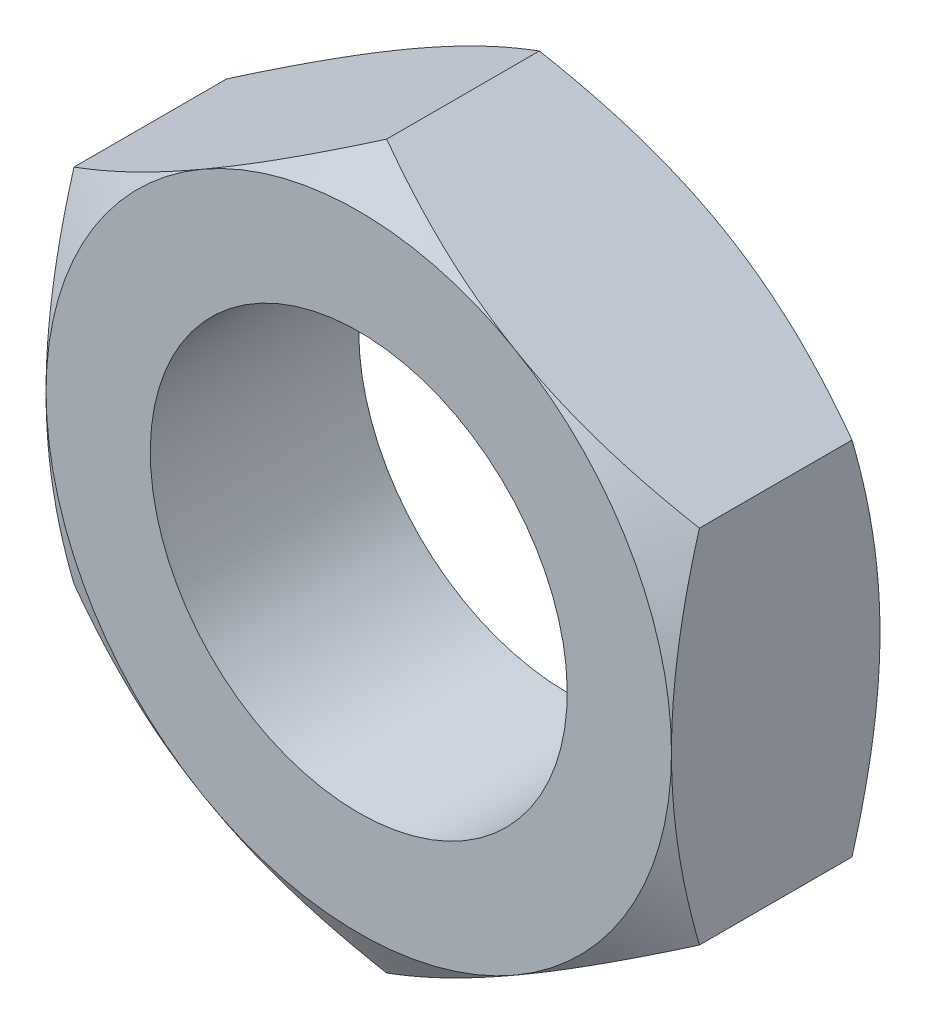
ISO-10303-21;
HEADER;
FILE_DESCRIPTION(('STEP AP214'),'2;1');
FILE_NAME('part.step','',(''),(''),'','','');
FILE_SCHEMA(('AUTOMOTIVE_DESIGN { 1 0 10303 214 1 1 1 1 }'));
ENDSEC;
DATA;
#1=APPLICATION_CONTEXT('core data for automotive mechanical design processes');
#2=APPLICATION_PROTOCOL_DEFINITION('international standard','automotive_design',2000,#1);
#3=PRODUCT_CONTEXT('',#1,'mechanical');
#4=PRODUCT('Part','Part','',(#3));
#5=PRODUCT_RELATED_PRODUCT_CATEGORY('part','',(#4));
#6=PRODUCT_DEFINITION_FORMATION('','',#4);
#7=PRODUCT_DEFINITION_CONTEXT('part definition',#1,'design');
#8=PRODUCT_DEFINITION('design','',#6,#7);
#9=PRODUCT_DEFINITION_SHAPE('','',#8);
#10=(LENGTH_UNIT() NAMED_UNIT(*) SI_UNIT(.MILLI.,.METRE.));
#11=(NAMED_UNIT(*) PLANE_ANGLE_UNIT() SI_UNIT($,.RADIAN.));
#12=(NAMED_UNIT(*) SI_UNIT($,.STERADIAN.) SOLID_ANGLE_UNIT());
#13=UNCERTAINTY_MEASURE_WITH_UNIT(LENGTH_MEASURE(1.E-05),#10,'distance_accuracy_value','');
#14=(GEOMETRIC_REPRESENTATION_CONTEXT(3) GLOBAL_UNCERTAINTY_ASSIGNED_CONTEXT((#13)) GLOBAL_UNIT_ASSIGNED_CONTEXT((#10,
#11,#12)) REPRESENTATION_CONTEXT('',''));
#15=CARTESIAN_POINT('',(0.,0.,0.));
#16=DIRECTION('',(0.,0.,1.));
#17=DIRECTION('',(1.,0.,0.));
#18=AXIS2_PLACEMENT_3D('',#15,#16,#17);
#19=CARTESIAN_POINT('',(8.,0.,0.));
#20=DIRECTION('',(0.,0.,-1.));
#21=DIRECTION('',(0.,1.,0.));
#22=AXIS2_PLACEMENT_3D('',#19,#20,#21);
#23=PLANE('',#22);
#24=CARTESIAN_POINT('',(0.,0.,0.));
#25=DIRECTION('',(0.,0.,-1.));
#26=DIRECTION('',(0.,1.,0.));
#27=AXIS2_PLACEMENT_3D('',#24,#25,#26);
#28=CIRCLE('',#27,8.);
#29=CARTESIAN_POINT('',(0.,8.,0.));
#30=VERTEX_POINT('',#29);
#31=EDGE_CURVE('E109',#30,#30,#28,.T.);
#32=ORIENTED_EDGE('',*,*,#31,.F.);
#33=EDGE_LOOP('',(#32));
#34=FACE_BOUND('',#33,.T.);
#35=CARTESIAN_POINT('',(0.,0.,0.));
#36=DIRECTION('',(0.,0.,1.));
#37=DIRECTION('',(0.,-1.,0.));
#38=AXIS2_PLACEMENT_3D('',#35,#36,#37);
#39=CIRCLE('',#38,12.);
#40=CARTESIAN_POINT('',(-6.,10.3923048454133,0.));
#41=VERTEX_POINT('',#40);
#42=CARTESIAN_POINT('',(-12.,0.,0.));
#43=VERTEX_POINT('',#42);
#44=EDGE_CURVE('E415',#41,#43,#39,.T.);
#45=ORIENTED_EDGE('',*,*,#44,.F.);
#46=CARTESIAN_POINT('',(0.,0.,0.));
#47=DIRECTION('',(0.,0.,1.));
#48=DIRECTION('',(0.,-1.,0.));
#49=AXIS2_PLACEMENT_3D('',#46,#47,#48);
#50=CIRCLE('',#49,12.);
#51=CARTESIAN_POINT('',(6.,10.3923048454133,0.));
#52=VERTEX_POINT('',#51);
#53=EDGE_CURVE('E104',#52,#41,#50,.T.);
#54=ORIENTED_EDGE('',*,*,#53,.F.);
#55=CARTESIAN_POINT('',(0.,0.,0.));
#56=DIRECTION('',(0.,0.,1.));
#57=DIRECTION('',(0.,-1.,0.));
#58=AXIS2_PLACEMENT_3D('',#55,#56,#57);
#59=CIRCLE('',#58,12.);
#60=CARTESIAN_POINT('',(12.,0.,0.));
#61=VERTEX_POINT('',#60);
#62=EDGE_CURVE('E17',#61,#52,#59,.T.);
#63=ORIENTED_EDGE('',*,*,#62,.F.);
#64=CARTESIAN_POINT('',(0.,0.,0.));
#65=DIRECTION('',(0.,0.,1.));
#66=DIRECTION('',(0.,-1.,0.));
#67=AXIS2_PLACEMENT_3D('',#64,#65,#66);
#68=CIRCLE('',#67,12.);
#69=CARTESIAN_POINT('',(6.,-10.3923048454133,0.));
#70=VERTEX_POINT('',#69);
#71=EDGE_CURVE('E101',#70,#61,#68,.T.);
#72=ORIENTED_EDGE('',*,*,#71,.F.);
#73=CARTESIAN_POINT('',(0.,0.,0.));
#74=DIRECTION('',(0.,0.,1.));
#75=DIRECTION('',(0.,-1.,0.));
#76=AXIS2_PLACEMENT_3D('',#73,#74,#75);
#77=CIRCLE('',#76,12.);
#78=CARTESIAN_POINT('',(-6.,-10.3923048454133,0.));
#79=VERTEX_POINT('',#78);
#80=EDGE_CURVE('E119',#79,#70,#77,.T.);
#81=ORIENTED_EDGE('',*,*,#80,.F.);
#82=CARTESIAN_POINT('',(0.,0.,0.));
#83=DIRECTION('',(0.,0.,1.));
#84=DIRECTION('',(0.,-1.,0.));
#85=AXIS2_PLACEMENT_3D('',#82,#83,#84);
#86=CIRCLE('',#85,12.);
#87=EDGE_CURVE('E417',#43,#79,#86,.T.);
#88=ORIENTED_EDGE('',*,*,#87,.F.);
#89=EDGE_LOOP('',(#45,#54,#63,#72,#81,#88));
#90=FACE_BOUND('',#89,.T.);
#91=ADVANCED_FACE('F14',(#34,#90),#23,.T.);
#92=CARTESIAN_POINT('',(0.,0.,1.07822755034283));
#93=DIRECTION('',(0.,0.,1.));
#94=DIRECTION('',(0.,-1.,0.));
#95=AXIS2_PLACEMENT_3D('',#92,#93,#94);
#96=CONICAL_SURFACE('',#95,13.8675448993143,1.0471975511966);
#97=CARTESIAN_POINT('',(12.,6.92820323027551,1.07179676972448));
#98=CARTESIAN_POINT('',(11.5113783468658,7.21030907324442,0.908940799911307));
#99=CARTESIAN_POINT('',(11.0191704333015,7.49448544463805,0.759755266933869));
#100=CARTESIAN_POINT('',(10.2769700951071,7.92299500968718,0.562274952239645));
#101=CARTESIAN_POINT('',(10.0295356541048,8.06585135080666,0.500950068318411));
#102=CARTESIAN_POINT('',(9.53304466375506,8.35250055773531,0.387776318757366));
#103=CARTESIAN_POINT('',(9.28398821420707,8.49629336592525,0.33592687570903));
#104=CARTESIAN_POINT('',(8.78411651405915,8.78489442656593,0.242530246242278));
#105=CARTESIAN_POINT('',(8.53329950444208,8.92970369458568,0.200995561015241));
#106=CARTESIAN_POINT('',(8.03046584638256,9.22001484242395,0.129101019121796));
#107=CARTESIAN_POINT('',(7.77844922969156,9.36551670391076,0.0987408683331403));
#108=CARTESIAN_POINT('',(7.2722827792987,9.65775204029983,0.0497242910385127));
#109=CARTESIAN_POINT('',(7.01812858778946,9.80448803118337,0.0311273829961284));
#110=CARTESIAN_POINT('',(6.50932036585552,10.0982485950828,0.00623934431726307));
#111=CARTESIAN_POINT('',(6.25466624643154,10.2452732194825,-4.93491989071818E-05));
#112=CARTESIAN_POINT('',(6.,10.3923048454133,0.));
#113=B_SPLINE_CURVE_WITH_KNOTS('',3,(#97,#98,#99,#100,#101,#102,#103,#104,#105,#106,#107,#108,
#109,#110,#111,#112),.UNSPECIFIED.,.F.,.F.,(4,2,2,2,2,2,2,4),(0.,1.76168798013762,
2.63822760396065,3.51471379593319,4.39225713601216,5.26977737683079,6.15170281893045,
7.03380287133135),.UNSPECIFIED.);
#114=CARTESIAN_POINT('',(12.,6.92820323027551,1.07179676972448));
#115=VERTEX_POINT('',#114);
#116=EDGE_CURVE('E124',#115,#52,#113,.T.);
#117=ORIENTED_EDGE('',*,*,#116,.F.);
#118=CARTESIAN_POINT('',(12.,0.,0.));
#119=CARTESIAN_POINT('',(12.,0.294063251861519,-4.93491989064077E-05));
#120=CARTESIAN_POINT('',(12.,0.588112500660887,0.00623934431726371));
#121=CARTESIAN_POINT('',(12.,1.17563362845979,0.0311273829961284));
#122=CARTESIAN_POINT('',(12.,1.46910561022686,0.0497242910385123));
#123=CARTESIAN_POINT('',(12.,2.05357628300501,0.09874086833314));
#124=CARTESIAN_POINT('',(12.,2.34458000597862,0.129101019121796));
#125=CARTESIAN_POINT('',(12.,2.92520230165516,0.200995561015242));
#126=CARTESIAN_POINT('',(12.,3.21482083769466,0.242530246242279));
#127=CARTESIAN_POINT('',(12.,3.79202295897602,0.335926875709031));
#128=CARTESIAN_POINT('',(12.,4.07960857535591,0.387776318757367));
#129=CARTESIAN_POINT('',(12.,4.65290698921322,0.500950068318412));
#130=CARTESIAN_POINT('',(12.,4.93861967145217,0.562274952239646));
#131=CARTESIAN_POINT('',(12.,5.79563880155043,0.759755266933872));
#132=CARTESIAN_POINT('',(12.,6.3639915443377,0.908940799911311));
#133=CARTESIAN_POINT('',(12.,6.92820323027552,1.07179676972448));
#134=B_SPLINE_CURVE_WITH_KNOTS('',3,(#118,#119,#120,#121,#122,#123,#124,#125,#126,#127,#128,
#129,#130,#131,#132,#133),.UNSPECIFIED.,.F.,.F.,(4,2,2,2,2,2,2,4),(0.,0.882100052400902,
1.76402549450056,2.64154573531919,3.51908907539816,4.3955752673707,5.27211489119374,
7.03380287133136),.UNSPECIFIED.);
#135=EDGE_CURVE('E121',#61,#115,#134,.T.);
#136=ORIENTED_EDGE('',*,*,#135,.F.);
#137=ORIENTED_EDGE('',*,*,#62,.T.);
#138=EDGE_LOOP('',(#117,#136,#137));
#139=FACE_BOUND('',#138,.T.);
#140=ADVANCED_FACE('F122',(#139),#96,.T.);
#141=CARTESIAN_POINT('',(0.,0.,1.07822755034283));
#142=DIRECTION('',(0.,0.,1.));
#143=DIRECTION('',(0.,-1.,0.));
#144=AXIS2_PLACEMENT_3D('',#141,#142,#143);
#145=CONICAL_SURFACE('',#144,13.8675448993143,1.0471975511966);
#146=CARTESIAN_POINT('',(0.,13.856406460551,1.07179676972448));
#147=CARTESIAN_POINT('',(-0.488621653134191,13.5743006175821,0.908940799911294));
#148=CARTESIAN_POINT('',(-0.980829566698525,13.2901242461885,0.759755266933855));
#149=CARTESIAN_POINT('',(-1.72302990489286,12.8616146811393,0.562274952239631));
#150=CARTESIAN_POINT('',(-1.97046434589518,12.7187583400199,0.500950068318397));
#151=CARTESIAN_POINT('',(-2.46695533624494,12.4321091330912,0.387776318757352));
#152=CARTESIAN_POINT('',(-2.71601178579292,12.2883163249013,0.335926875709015));
#153=CARTESIAN_POINT('',(-3.21588348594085,11.9997152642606,0.242530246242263));
#154=CARTESIAN_POINT('',(-3.46670049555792,11.8549059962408,0.200995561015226));
#155=CARTESIAN_POINT('',(-3.96953415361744,11.5645948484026,0.129101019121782));
#156=CARTESIAN_POINT('',(-4.22155077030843,11.4190929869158,0.0987408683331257));
#157=CARTESIAN_POINT('',(-4.7277172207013,11.1268576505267,0.0497242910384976));
#158=CARTESIAN_POINT('',(-4.98187141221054,10.9801216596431,0.0311273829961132));
#159=CARTESIAN_POINT('',(-5.49067963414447,10.6863610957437,0.00623934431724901));
#160=CARTESIAN_POINT('',(-5.74533375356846,10.539336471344,-4.93491989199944E-05));
#161=CARTESIAN_POINT('',(-6.,10.3923048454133,0.));
#162=B_SPLINE_CURVE_WITH_KNOTS('',3,(#146,#147,#148,#149,#150,#151,#152,#153,#154,#155,#156,
#157,#158,#159,#160,#161),.UNSPECIFIED.,.F.,.F.,(4,2,2,2,2,2,2,4),(0.,1.76168798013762,
2.63822760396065,3.51471379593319,4.39225713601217,5.26977737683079,6.15170281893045,
7.03380287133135),.UNSPECIFIED.);
#163=CARTESIAN_POINT('',(0.,13.856406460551,1.07179676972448));
#164=VERTEX_POINT('',#163);
#165=EDGE_CURVE('E294',#164,#41,#162,.T.);
#166=ORIENTED_EDGE('',*,*,#165,.F.);
#167=CARTESIAN_POINT('',(6.,10.3923048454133,0.));
#168=CARTESIAN_POINT('',(5.74533375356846,10.539336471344,-4.93491989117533E-05));
#169=CARTESIAN_POINT('',(5.49067963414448,10.6863610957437,0.0062393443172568));
#170=CARTESIAN_POINT('',(4.98187141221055,10.9801216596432,0.0311273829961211));
#171=CARTESIAN_POINT('',(4.7277172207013,11.1268576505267,0.049724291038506));
#172=CARTESIAN_POINT('',(4.22155077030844,11.4190929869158,0.0987408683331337));
#173=CARTESIAN_POINT('',(3.96953415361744,11.5645948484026,0.129101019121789));
#174=CARTESIAN_POINT('',(3.46670049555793,11.8549059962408,0.200995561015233));
#175=CARTESIAN_POINT('',(3.21588348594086,11.9997152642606,0.242530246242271));
#176=CARTESIAN_POINT('',(2.71601178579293,12.2883163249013,0.335926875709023));
#177=CARTESIAN_POINT('',(2.46695533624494,12.4321091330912,0.387776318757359));
#178=CARTESIAN_POINT('',(1.97046434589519,12.7187583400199,0.500950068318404));
#179=CARTESIAN_POINT('',(1.72302990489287,12.8616146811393,0.562274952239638));
#180=CARTESIAN_POINT('',(0.980829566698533,13.2901242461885,0.759755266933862));
#181=CARTESIAN_POINT('',(0.4886216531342,13.5743006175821,0.908940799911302));
#182=CARTESIAN_POINT('',(0.,13.856406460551,1.07179676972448));
#183=B_SPLINE_CURVE_WITH_KNOTS('',3,(#167,#168,#169,#170,#171,#172,#173,#174,#175,#176,#177,
#178,#179,#180,#181,#182),.UNSPECIFIED.,.F.,.F.,(4,2,2,2,2,2,2,4),(0.,0.882100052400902,
1.76402549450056,2.64154573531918,3.51908907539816,4.3955752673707,5.27211489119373,
7.03380287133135),.UNSPECIFIED.);
#184=EDGE_CURVE('E302',#52,#164,#183,.T.);
#185=ORIENTED_EDGE('',*,*,#184,.F.);
#186=ORIENTED_EDGE('',*,*,#53,.T.);
#187=EDGE_LOOP('',(#166,#185,#186));
#188=FACE_BOUND('',#187,.T.);
#189=ADVANCED_FACE('F283',(#188),#145,.T.);
#190=CARTESIAN_POINT('',(0.,0.,1.07822755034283));
#191=DIRECTION('',(0.,0.,1.));
#192=DIRECTION('',(0.,-1.,0.));
#193=AXIS2_PLACEMENT_3D('',#190,#191,#192);
#194=CONICAL_SURFACE('',#193,13.8675448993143,1.0471975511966);
#195=CARTESIAN_POINT('',(-12.,6.92820323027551,1.07179676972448));
#196=CARTESIAN_POINT('',(-12.,6.36399154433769,0.908940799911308));
#197=CARTESIAN_POINT('',(-12.,5.79563880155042,0.759755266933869));
#198=CARTESIAN_POINT('',(-12.,4.93861967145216,0.562274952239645));
#199=CARTESIAN_POINT('',(-12.,4.65290698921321,0.50095006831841));
#200=CARTESIAN_POINT('',(-12.,4.07960857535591,0.387776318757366));
#201=CARTESIAN_POINT('',(-12.,3.79202295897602,0.335926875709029));
#202=CARTESIAN_POINT('',(-12.,3.21482083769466,0.242530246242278));
#203=CARTESIAN_POINT('',(-12.,2.92520230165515,0.200995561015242));
#204=CARTESIAN_POINT('',(-12.,2.34458000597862,0.129101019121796));
#205=CARTESIAN_POINT('',(-12.,2.05357628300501,0.0987408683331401));
#206=CARTESIAN_POINT('',(-12.,1.46910561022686,0.0497242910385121));
#207=CARTESIAN_POINT('',(-12.,1.17563362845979,0.0311273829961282));
#208=CARTESIAN_POINT('',(-12.,0.588112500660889,0.00623934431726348));
#209=CARTESIAN_POINT('',(-12.,0.294063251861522,-4.93491989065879E-05));
#210=CARTESIAN_POINT('',(-12.,0.,0.));
#211=B_SPLINE_CURVE_WITH_KNOTS('',3,(#195,#196,#197,#198,#199,#200,#201,#202,#203,#204,#205,
#206,#207,#208,#209,#210),.UNSPECIFIED.,.F.,.F.,(4,2,2,2,2,2,2,4),(0.,1.76168798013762,
2.63822760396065,3.51471379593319,4.39225713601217,5.26977737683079,6.15170281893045,
7.03380287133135),.UNSPECIFIED.);
#212=CARTESIAN_POINT('',(-12.,6.9282032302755,1.07179676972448));
#213=VERTEX_POINT('',#212);
#214=EDGE_CURVE('E262',#213,#43,#211,.T.);
#215=ORIENTED_EDGE('',*,*,#214,.F.);
#216=CARTESIAN_POINT('',(-6.,10.3923048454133,0.));
#217=CARTESIAN_POINT('',(-6.25466624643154,10.2452732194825,-4.93491989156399E-05));
#218=CARTESIAN_POINT('',(-6.50932036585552,10.0982485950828,0.00623934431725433));
#219=CARTESIAN_POINT('',(-7.01812858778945,9.80448803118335,0.03112738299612));
#220=CARTESIAN_POINT('',(-7.27228277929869,9.65775204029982,0.0497242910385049));
#221=CARTESIAN_POINT('',(-7.77844922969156,9.36551670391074,0.098740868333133));
#222=CARTESIAN_POINT('',(-8.03046584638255,9.22001484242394,0.129101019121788));
#223=CARTESIAN_POINT('',(-8.53329950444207,8.92970369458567,0.200995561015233));
#224=CARTESIAN_POINT('',(-8.78411651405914,8.78489442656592,0.24253024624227));
#225=CARTESIAN_POINT('',(-9.28398821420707,8.49629336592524,0.335926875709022));
#226=CARTESIAN_POINT('',(-9.53304466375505,8.3525005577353,0.387776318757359));
#227=CARTESIAN_POINT('',(-10.0295356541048,8.06585135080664,0.500950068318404));
#228=CARTESIAN_POINT('',(-10.2769700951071,7.92299500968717,0.562274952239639));
#229=CARTESIAN_POINT('',(-11.0191704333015,7.49448544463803,0.759755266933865));
#230=CARTESIAN_POINT('',(-11.5113783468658,7.2103090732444,0.908940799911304));
#231=CARTESIAN_POINT('',(-12.,6.92820323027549,1.07179676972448));
#232=B_SPLINE_CURVE_WITH_KNOTS('',3,(#216,#217,#218,#219,#220,#221,#222,#223,#224,#225,#226,
#227,#228,#229,#230,#231),.UNSPECIFIED.,.F.,.F.,(4,2,2,2,2,2,2,4),(0.,0.882100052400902,
1.76402549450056,2.64154573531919,3.51908907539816,4.3955752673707,5.27211489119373,
7.03380287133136),.UNSPECIFIED.);
#233=EDGE_CURVE('E287',#41,#213,#232,.T.);
#234=ORIENTED_EDGE('',*,*,#233,.F.);
#235=ORIENTED_EDGE('',*,*,#44,.T.);
#236=EDGE_LOOP('',(#215,#234,#235));
#237=FACE_BOUND('',#236,.T.);
#238=ADVANCED_FACE('F277',(#237),#194,.T.);
#239=CARTESIAN_POINT('',(0.,0.,1.07822755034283));
#240=DIRECTION('',(0.,0.,1.));
#241=DIRECTION('',(0.,-1.,0.));
#242=AXIS2_PLACEMENT_3D('',#239,#240,#241);
#243=CONICAL_SURFACE('',#242,13.8675448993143,1.0471975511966);
#244=CARTESIAN_POINT('',(-12.,0.,0.));
#245=CARTESIAN_POINT('',(-12.,-0.294063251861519,-4.934919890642E-05));
#246=CARTESIAN_POINT('',(-12.,-0.588112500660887,0.00623934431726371));
#247=CARTESIAN_POINT('',(-12.,-1.17563362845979,0.0311273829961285));
#248=CARTESIAN_POINT('',(-12.,-1.46910561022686,0.0497242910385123));
#249=CARTESIAN_POINT('',(-12.,-2.05357628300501,0.0987408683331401));
#250=CARTESIAN_POINT('',(-12.,-2.34458000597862,0.129101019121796));
#251=CARTESIAN_POINT('',(-12.,-2.92520230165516,0.200995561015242));
#252=CARTESIAN_POINT('',(-12.,-3.21482083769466,0.242530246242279));
#253=CARTESIAN_POINT('',(-12.,-3.79202295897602,0.335926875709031));
#254=CARTESIAN_POINT('',(-12.,-4.07960857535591,0.387776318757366));
#255=CARTESIAN_POINT('',(-12.,-4.65290698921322,0.500950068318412));
#256=CARTESIAN_POINT('',(-12.,-4.93861967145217,0.562274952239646));
#257=CARTESIAN_POINT('',(-12.,-5.79563880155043,0.759755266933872));
#258=CARTESIAN_POINT('',(-12.,-6.3639915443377,0.908940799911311));
#259=CARTESIAN_POINT('',(-12.,-6.92820323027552,1.07179676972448));
#260=B_SPLINE_CURVE_WITH_KNOTS('',3,(#244,#245,#246,#247,#248,#249,#250,#251,#252,#253,#254,
#255,#256,#257,#258,#259),.UNSPECIFIED.,.F.,.F.,(4,2,2,2,2,2,2,4),(0.,0.882100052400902,
1.76402549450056,2.64154573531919,3.51908907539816,4.39557526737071,5.27211489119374,
7.03380287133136),.UNSPECIFIED.);
#261=CARTESIAN_POINT('',(-12.,-6.92820323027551,1.07179676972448));
#262=VERTEX_POINT('',#261);
#263=EDGE_CURVE('E255',#43,#262,#260,.T.);
#264=ORIENTED_EDGE('',*,*,#263,.F.);
#265=ORIENTED_EDGE('',*,*,#87,.T.);
#266=CARTESIAN_POINT('',(-12.,-6.92820323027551,1.07179676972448));
#267=CARTESIAN_POINT('',(-11.5113783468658,-7.21030907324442,0.908940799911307));
#268=CARTESIAN_POINT('',(-11.0191704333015,-7.49448544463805,0.759755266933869));
#269=CARTESIAN_POINT('',(-10.2769700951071,-7.92299500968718,0.562274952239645));
#270=CARTESIAN_POINT('',(-10.0295356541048,-8.06585135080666,0.500950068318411));
#271=CARTESIAN_POINT('',(-9.53304466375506,-8.35250055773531,0.387776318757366));
#272=CARTESIAN_POINT('',(-9.28398821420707,-8.49629336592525,0.33592687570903));
#273=CARTESIAN_POINT('',(-8.78411651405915,-8.78489442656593,0.242530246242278));
#274=CARTESIAN_POINT('',(-8.53329950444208,-8.92970369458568,0.200995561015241));
#275=CARTESIAN_POINT('',(-8.03046584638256,-9.22001484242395,0.129101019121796));
#276=CARTESIAN_POINT('',(-7.77844922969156,-9.36551670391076,0.0987408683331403));
#277=CARTESIAN_POINT('',(-7.2722827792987,-9.65775204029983,0.0497242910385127));
#278=CARTESIAN_POINT('',(-7.01812858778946,-9.80448803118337,0.0311273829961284));
#279=CARTESIAN_POINT('',(-6.50932036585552,-10.0982485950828,0.00623934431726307));
#280=CARTESIAN_POINT('',(-6.25466624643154,-10.2452732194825,-4.93491989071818E-05));
#281=CARTESIAN_POINT('',(-6.,-10.3923048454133,0.));
#282=B_SPLINE_CURVE_WITH_KNOTS('',3,(#266,#267,#268,#269,#270,#271,#272,#273,#274,#275,#276,
#277,#278,#279,#280,#281),.UNSPECIFIED.,.F.,.F.,(4,2,2,2,2,2,2,4),(0.,1.76168798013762,
2.63822760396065,3.51471379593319,4.39225713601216,5.26977737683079,6.15170281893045,
7.03380287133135),.UNSPECIFIED.);
#283=EDGE_CURVE('E263',#262,#79,#282,.T.);
#284=ORIENTED_EDGE('',*,*,#283,.F.);
#285=EDGE_LOOP('',(#264,#265,#284));
#286=FACE_BOUND('',#285,.T.);
#287=ADVANCED_FACE('F274',(#286),#243,.T.);
#288=CARTESIAN_POINT('',(0.,0.,1.07822755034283));
#289=DIRECTION('',(0.,0.,1.));
#290=DIRECTION('',(0.,-1.,0.));
#291=AXIS2_PLACEMENT_3D('',#288,#289,#290);
#292=CONICAL_SURFACE('',#291,13.8675448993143,1.0471975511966);
#293=CARTESIAN_POINT('',(0.,-13.856406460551,1.07179676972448));
#294=CARTESIAN_POINT('',(0.48862165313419,-13.5743006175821,0.908940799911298));
#295=CARTESIAN_POINT('',(0.980829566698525,-13.2901242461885,0.759755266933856));
#296=CARTESIAN_POINT('',(1.72302990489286,-12.8616146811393,0.56227495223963));
#297=CARTESIAN_POINT('',(1.97046434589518,-12.7187583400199,0.500950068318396));
#298=CARTESIAN_POINT('',(2.46695533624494,-12.4321091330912,0.38777631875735));
#299=CARTESIAN_POINT('',(2.71601178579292,-12.2883163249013,0.335926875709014));
#300=CARTESIAN_POINT('',(3.21588348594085,-11.9997152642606,0.242530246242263));
#301=CARTESIAN_POINT('',(3.46670049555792,-11.8549059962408,0.200995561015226));
#302=CARTESIAN_POINT('',(3.96953415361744,-11.5645948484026,0.129101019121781));
#303=CARTESIAN_POINT('',(4.22155077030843,-11.4190929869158,0.0987408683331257));
#304=CARTESIAN_POINT('',(4.7277172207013,-11.1268576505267,0.0497242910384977));
#305=CARTESIAN_POINT('',(4.98187141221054,-10.9801216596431,0.0311273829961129));
#306=CARTESIAN_POINT('',(5.49067963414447,-10.6863610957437,0.00623934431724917));
#307=CARTESIAN_POINT('',(5.74533375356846,-10.539336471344,-4.93491989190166E-05));
#308=CARTESIAN_POINT('',(6.,-10.3923048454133,0.));
#309=B_SPLINE_CURVE_WITH_KNOTS('',3,(#293,#294,#295,#296,#297,#298,#299,#300,#301,#302,#303,
#304,#305,#306,#307,#308),.UNSPECIFIED.,.F.,.F.,(4,2,2,2,2,2,2,4),(0.,1.76168798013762,
2.63822760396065,3.51471379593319,4.39225713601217,5.26977737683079,6.15170281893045,
7.03380287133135),.UNSPECIFIED.);
#310=CARTESIAN_POINT('',(0.,-13.856406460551,1.07179676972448));
#311=VERTEX_POINT('',#310);
#312=EDGE_CURVE('E163',#311,#70,#309,.T.);
#313=ORIENTED_EDGE('',*,*,#312,.F.);
#314=CARTESIAN_POINT('',(-6.,-10.3923048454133,0.));
#315=CARTESIAN_POINT('',(-5.74533375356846,-10.539336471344,-4.93491989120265E-05));
#316=CARTESIAN_POINT('',(-5.49067963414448,-10.6863610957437,0.00623934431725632));
#317=CARTESIAN_POINT('',(-4.98187141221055,-10.9801216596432,0.0311273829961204));
#318=CARTESIAN_POINT('',(-4.72771722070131,-11.1268576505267,0.0497242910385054));
#319=CARTESIAN_POINT('',(-4.22155077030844,-11.4190929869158,0.0987408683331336));
#320=CARTESIAN_POINT('',(-3.96953415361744,-11.5645948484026,0.129101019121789));
#321=CARTESIAN_POINT('',(-3.46670049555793,-11.8549059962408,0.200995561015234));
#322=CARTESIAN_POINT('',(-3.21588348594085,-11.9997152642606,0.242530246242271));
#323=CARTESIAN_POINT('',(-2.71601178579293,-12.2883163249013,0.335926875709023));
#324=CARTESIAN_POINT('',(-2.46695533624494,-12.4321091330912,0.387776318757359));
#325=CARTESIAN_POINT('',(-1.97046434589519,-12.7187583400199,0.500950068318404));
#326=CARTESIAN_POINT('',(-1.72302990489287,-12.8616146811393,0.562274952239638));
#327=CARTESIAN_POINT('',(-0.980829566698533,-13.2901242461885,0.759755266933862));
#328=CARTESIAN_POINT('',(-0.488621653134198,-13.5743006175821,0.908940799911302));
#329=CARTESIAN_POINT('',(0.,-13.856406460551,1.07179676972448));
#330=B_SPLINE_CURVE_WITH_KNOTS('',3,(#314,#315,#316,#317,#318,#319,#320,#321,#322,#323,#324,
#325,#326,#327,#328,#329),.UNSPECIFIED.,.F.,.F.,(4,2,2,2,2,2,2,4),(0.,0.8821000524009,
1.76402549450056,2.64154573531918,3.51908907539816,4.3955752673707,5.27211489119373,
7.03380287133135),.UNSPECIFIED.);
#331=EDGE_CURVE('E368',#79,#311,#330,.T.);
#332=ORIENTED_EDGE('',*,*,#331,.F.);
#333=ORIENTED_EDGE('',*,*,#80,.T.);
#334=EDGE_LOOP('',(#313,#332,#333));
#335=FACE_BOUND('',#334,.T.);
#336=ADVANCED_FACE('F150',(#335),#292,.T.);
#337=CARTESIAN_POINT('',(0.,0.,1.07822755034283));
#338=DIRECTION('',(0.,0.,1.));
#339=DIRECTION('',(0.,-1.,0.));
#340=AXIS2_PLACEMENT_3D('',#337,#338,#339);
#341=CONICAL_SURFACE('',#340,13.8675448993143,1.0471975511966);
#342=CARTESIAN_POINT('',(12.,-6.92820323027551,1.07179676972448));
#343=CARTESIAN_POINT('',(12.,-6.36399154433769,0.908940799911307));
#344=CARTESIAN_POINT('',(12.,-5.79563880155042,0.759755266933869));
#345=CARTESIAN_POINT('',(12.,-4.93861967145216,0.562274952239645));
#346=CARTESIAN_POINT('',(12.,-4.65290698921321,0.500950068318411));
#347=CARTESIAN_POINT('',(12.,-4.0796085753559,0.387776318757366));
#348=CARTESIAN_POINT('',(12.,-3.79202295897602,0.33592687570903));
#349=CARTESIAN_POINT('',(12.,-3.21482083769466,0.242530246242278));
#350=CARTESIAN_POINT('',(12.,-2.92520230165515,0.20099556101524));
#351=CARTESIAN_POINT('',(12.,-2.34458000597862,0.129101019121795));
#352=CARTESIAN_POINT('',(12.,-2.05357628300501,0.0987408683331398));
#353=CARTESIAN_POINT('',(12.,-1.46910561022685,0.0497242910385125));
#354=CARTESIAN_POINT('',(12.,-1.17563362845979,0.0311273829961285));
#355=CARTESIAN_POINT('',(12.,-0.588112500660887,0.00623934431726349));
#356=CARTESIAN_POINT('',(12.,-0.29406325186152,-4.93491989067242E-05));
#357=CARTESIAN_POINT('',(12.,0.,0.));
#358=B_SPLINE_CURVE_WITH_KNOTS('',3,(#342,#343,#344,#345,#346,#347,#348,#349,#350,#351,#352,
#353,#354,#355,#356,#357),.UNSPECIFIED.,.F.,.F.,(4,2,2,2,2,2,2,4),(0.,1.76168798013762,
2.63822760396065,3.51471379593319,4.39225713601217,5.26977737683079,6.15170281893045,
7.03380287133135),.UNSPECIFIED.);
#359=CARTESIAN_POINT('',(12.,-6.9282032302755,1.07179676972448));
#360=VERTEX_POINT('',#359);
#361=EDGE_CURVE('E114',#360,#61,#358,.T.);
#362=ORIENTED_EDGE('',*,*,#361,.F.);
#363=CARTESIAN_POINT('',(6.,-10.3923048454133,0.));
#364=CARTESIAN_POINT('',(6.25466624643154,-10.2452732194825,-4.93491989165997E-05));
#365=CARTESIAN_POINT('',(6.50932036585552,-10.0982485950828,0.00623934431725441));
#366=CARTESIAN_POINT('',(7.01812858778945,-9.80448803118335,0.0311273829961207));
#367=CARTESIAN_POINT('',(7.27228277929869,-9.65775204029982,0.0497242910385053));
#368=CARTESIAN_POINT('',(7.77844922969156,-9.36551670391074,0.0987408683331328));
#369=CARTESIAN_POINT('',(8.03046584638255,-9.22001484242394,0.129101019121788));
#370=CARTESIAN_POINT('',(8.53329950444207,-8.92970369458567,0.200995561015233));
#371=CARTESIAN_POINT('',(8.78411651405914,-8.78489442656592,0.24253024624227));
#372=CARTESIAN_POINT('',(9.28398821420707,-8.49629336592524,0.335926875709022));
#373=CARTESIAN_POINT('',(9.53304466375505,-8.3525005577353,0.387776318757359));
#374=CARTESIAN_POINT('',(10.0295356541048,-8.06585135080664,0.500950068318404));
#375=CARTESIAN_POINT('',(10.2769700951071,-7.92299500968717,0.562274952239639));
#376=CARTESIAN_POINT('',(11.0191704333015,-7.49448544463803,0.759755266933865));
#377=CARTESIAN_POINT('',(11.5113783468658,-7.2103090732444,0.908940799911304));
#378=CARTESIAN_POINT('',(12.,-6.92820323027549,1.07179676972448));
#379=B_SPLINE_CURVE_WITH_KNOTS('',3,(#363,#364,#365,#366,#367,#368,#369,#370,#371,#372,#373,
#374,#375,#376,#377,#378),.UNSPECIFIED.,.F.,.F.,(4,2,2,2,2,2,2,4),(0.,0.882100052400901,
1.76402549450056,2.64154573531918,3.51908907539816,4.3955752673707,5.27211489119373,
7.03380287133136),.UNSPECIFIED.);
#380=EDGE_CURVE('E117',#70,#360,#379,.T.);
#381=ORIENTED_EDGE('',*,*,#380,.F.);
#382=ORIENTED_EDGE('',*,*,#71,.T.);
#383=EDGE_LOOP('',(#362,#381,#382));
#384=FACE_BOUND('',#383,.T.);
#385=ADVANCED_FACE('F112',(#384),#341,.T.);
#386=CARTESIAN_POINT('',(12.,-6.92820323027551,0.));
#387=DIRECTION('',(1.,0.,0.));
#388=DIRECTION('',(0.,1.,0.));
#389=AXIS2_PLACEMENT_3D('',#386,#387,#388);
#390=PLANE('',#389);
#391=ORIENTED_EDGE('',*,*,#361,.T.);
#392=ORIENTED_EDGE('',*,*,#135,.T.);
#393=DIRECTION('',(0.,0.,1.));
#394=VECTOR('',#393,1.);
#395=CARTESIAN_POINT('',(12.,6.92820323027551,0.));
#396=LINE('',#395,#394);
#397=CARTESIAN_POINT('',(12.0000000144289,6.92820322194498,6.92820322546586));
#398=VERTEX_POINT('',#397);
#399=EDGE_CURVE('E127',#398,#115,#396,.F.);
#400=ORIENTED_EDGE('',*,*,#399,.F.);
#401=CARTESIAN_POINT('',(12.,0.,8.));
#402=CARTESIAN_POINT('',(12.,0.294063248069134,8.00004934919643));
#403=CARTESIAN_POINT('',(12.,0.588112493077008,7.99376065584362));
#404=CARTESIAN_POINT('',(12.,1.17563361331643,7.96887261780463));
#405=CARTESIAN_POINT('',(12.,1.4691055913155,7.95027571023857));
#406=CARTESIAN_POINT('',(12.,2.05357625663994,7.90125913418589));
#407=CARTESIAN_POINT('',(12.,2.34457997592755,7.87089898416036));
#408=CARTESIAN_POINT('',(12.,2.92520226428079,7.79900444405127));
#409=CARTESIAN_POINT('',(12.,3.214820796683,7.75746975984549));
#410=CARTESIAN_POINT('',(12.,3.79202291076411,7.66407313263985));
#411=CARTESIAN_POINT('',(12.,4.07960852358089,7.61222369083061));
#412=CARTESIAN_POINT('',(12.,4.65290693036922,7.49904994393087));
#413=CARTESIAN_POINT('',(12.,4.93861960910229,7.43772506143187));
#414=CARTESIAN_POINT('',(12.,5.79563872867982,7.24024475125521));
#415=CARTESIAN_POINT('',(12.,6.36399146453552,7.09105922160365));
#416=CARTESIAN_POINT('',(12.,6.928203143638,6.92820325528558));
#417=B_SPLINE_CURVE_WITH_KNOTS('',3,(#401,#402,#403,#404,#405,#406,#407,#408,#409,#410,#411,
#412,#413,#414,#415,#416),.UNSPECIFIED.,.F.,.F.,(4,2,2,2,2,2,2,4),(0.,0.882100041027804,
1.76402547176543,2.64154570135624,3.51908903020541,4.39557521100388,5.27211482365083,
7.03380278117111),.UNSPECIFIED.);
#418=CARTESIAN_POINT('',(12.,0.,8.));
#419=VERTEX_POINT('',#418);
#420=EDGE_CURVE('E348',#419,#398,#417,.T.);
#421=ORIENTED_EDGE('',*,*,#420,.F.);
#422=CARTESIAN_POINT('',(11.9999999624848,-6.92820325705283,6.92820319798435));
#423=CARTESIAN_POINT('',(11.9999999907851,-6.36399157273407,7.0910591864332));
#424=CARTESIAN_POINT('',(11.9999999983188,-5.7956388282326,7.24024472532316));
#425=CARTESIAN_POINT('',(12.0000000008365,-4.93861969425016,7.43772504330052));
#426=CARTESIAN_POINT('',(12.0000000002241,-4.65290701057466,7.49904992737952));
#427=CARTESIAN_POINT('',(11.9999999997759,-4.07960859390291,7.61222367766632));
#428=CARTESIAN_POINT('',(11.9999999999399,-3.79202297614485,7.6640731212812));
#429=CARTESIAN_POINT('',(12.0000000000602,-3.21482085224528,7.75746975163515));
#430=CARTESIAN_POINT('',(12.0000000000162,-2.92520231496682,7.79900443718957));
#431=CARTESIAN_POINT('',(11.9999999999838,-2.3445800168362,7.87089897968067));
#432=CARTESIAN_POINT('',(11.9999999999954,-2.05357629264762,7.90125913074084));
#433=CARTESIAN_POINT('',(12.0000000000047,-1.46910561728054,7.95027570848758));
#434=CARTESIAN_POINT('',(12.0000000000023,-1.17563363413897,7.96887261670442));
#435=CARTESIAN_POINT('',(11.9999999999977,-0.588112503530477,7.9937606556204));
#436=CARTESIAN_POINT('',(11.9999999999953,-0.294063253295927,8.00004934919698));
#437=CARTESIAN_POINT('',(12.,0.,8.));
#438=B_SPLINE_CURVE_WITH_KNOTS('',3,(#422,#423,#424,#425,#426,#427,#428,#429,#430,#431,#432,
#433,#434,#435,#436,#437),.UNSPECIFIED.,.F.,.F.,(4,2,2,2,2,2,2,4),(0.,1.76168798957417,
2.63822761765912,3.51471381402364,4.3922571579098,5.26977740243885,6.15170284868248,
7.03380290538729),.UNSPECIFIED.);
#439=CARTESIAN_POINT('',(12.,-6.92820324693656,6.92820322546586));
#440=VERTEX_POINT('',#439);
#441=EDGE_CURVE('E354',#440,#419,#438,.T.);
#442=ORIENTED_EDGE('',*,*,#441,.F.);
#443=DIRECTION('',(0.,0.,1.));
#444=VECTOR('',#443,1.);
#445=CARTESIAN_POINT('',(12.,-6.9282032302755,0.));
#446=LINE('',#445,#444);
#447=EDGE_CURVE('E131',#360,#440,#446,.T.);
#448=ORIENTED_EDGE('',*,*,#447,.F.);
#449=EDGE_LOOP('',(#391,#392,#400,#421,#442,#448));
#450=FACE_BOUND('',#449,.T.);
#451=ADVANCED_FACE('F129',(#450),#390,.T.);
#452=CARTESIAN_POINT('',(12.,6.92820323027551,0.));
#453=DIRECTION('',(0.5,0.866025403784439,0.));
#454=DIRECTION('',(-0.866025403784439,0.5,0.));
#455=AXIS2_PLACEMENT_3D('',#452,#453,#454);
#456=PLANE('',#455);
#457=ORIENTED_EDGE('',*,*,#116,.T.);
#458=ORIENTED_EDGE('',*,*,#184,.T.);
#459=DIRECTION('',(0.,0.,1.));
#460=VECTOR('',#459,1.);
#461=CARTESIAN_POINT('',(0.,13.856406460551,0.));
#462=LINE('',#461,#460);
#463=CARTESIAN_POINT('',(-1.15431313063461E-08,13.8564064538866,6.92820323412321));
#464=VERTEX_POINT('',#463);
#465=EDGE_CURVE('E301',#464,#164,#462,.F.);
#466=ORIENTED_EDGE('',*,*,#465,.F.);
#467=CARTESIAN_POINT('',(6.,10.3923048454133,8.));
#468=CARTESIAN_POINT('',(5.74533375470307,10.539336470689,8.00004934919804));
#469=CARTESIAN_POINT('',(5.49067963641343,10.6863610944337,7.99376065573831));
#470=CARTESIAN_POINT('',(4.98187141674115,10.9801216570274,7.9688726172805));
#471=CARTESIAN_POINT('',(4.72771722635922,11.1268576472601,7.95027570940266));
#472=CARTESIAN_POINT('',(4.22155077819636,11.4190929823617,7.90125913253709));
#473=CARTESIAN_POINT('',(3.96953416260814,11.5645948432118,7.87089898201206));
#474=CARTESIAN_POINT('',(3.46670050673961,11.8549059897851,7.79900444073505));
#475=CARTESIAN_POINT('',(3.21588349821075,11.9997152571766,7.75746975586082));
#476=CARTESIAN_POINT('',(2.716011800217,12.2883163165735,7.6640731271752));
#477=CARTESIAN_POINT('',(2.46695535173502,12.432109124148,7.61222368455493));
#478=CARTESIAN_POINT('',(1.97046436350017,12.7187583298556,7.49904993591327));
#479=CARTESIAN_POINT('',(1.72302992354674,12.8616146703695,7.43772505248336));
#480=CARTESIAN_POINT('',(0.980829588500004,13.2901242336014,7.2402447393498));
#481=CARTESIAN_POINT('',(0.488621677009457,13.5743006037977,7.09105920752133));
#482=CARTESIAN_POINT('',(2.59202580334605E-08,13.8564064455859,6.92820323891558));
#483=B_SPLINE_CURVE_WITH_KNOTS('',3,(#467,#468,#469,#470,#471,#472,#473,#474,#475,#476,#477,
#478,#479,#480,#481,#482),.UNSPECIFIED.,.F.,.F.,(4,2,2,2,2,2,2,4),(0.,0.882100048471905,
1.76402548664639,2.64154572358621,3.51908905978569,4.39557524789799,5.27211486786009,
7.03380284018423),.UNSPECIFIED.);
#484=CARTESIAN_POINT('',(6.,10.3923048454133,8.));
#485=VERTEX_POINT('',#484);
#486=EDGE_CURVE('E326',#485,#464,#483,.T.);
#487=ORIENTED_EDGE('',*,*,#486,.F.);
#488=CARTESIAN_POINT('',(12.0000000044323,6.92820318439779,6.92820319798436));
#489=CARTESIAN_POINT('',(11.5113783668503,7.21030905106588,7.0910591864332));
#490=CARTESIAN_POINT('',(11.0191704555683,7.49448542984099,7.24024472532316));
#491=CARTESIAN_POINT('',(10.276970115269,7.92299499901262,7.43772504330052));
#492=CARTESIAN_POINT('',(10.0295356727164,8.06585134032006,7.49904992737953));
#493=CARTESIAN_POINT('',(9.53304467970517,8.3525005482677,7.61222367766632));
#494=CARTESIAN_POINT('',(9.28398822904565,8.49629335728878,7.6640731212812));
#495=CARTESIAN_POINT('',(8.78411652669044,8.78489441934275,7.75746975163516));
#496=CARTESIAN_POINT('',(8.53329951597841,8.92970368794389,7.79900443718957));
#497=CARTESIAN_POINT('',(8.03046585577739,9.22001483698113,7.87089897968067));
#498=CARTESIAN_POINT('',(7.77844923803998,9.36551669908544,7.90125913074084));
#499=CARTESIAN_POINT('',(7.27228278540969,9.65775203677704,7.95027570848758));
#500=CARTESIAN_POINT('',(7.01812859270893,9.8044880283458,7.96887261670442));
#501=CARTESIAN_POINT('',(6.50932036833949,10.098248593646,7.9937606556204));
#502=CARTESIAN_POINT('',(6.25466624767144,10.2452732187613,8.00004934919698));
#503=CARTESIAN_POINT('',(6.,10.3923048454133,8.));
#504=B_SPLINE_CURVE_WITH_KNOTS('',3,(#488,#489,#490,#491,#492,#493,#494,#495,#496,#497,#498,
#499,#500,#501,#502,#503),.UNSPECIFIED.,.F.,.F.,(4,2,2,2,2,2,2,4),(0.,1.76168798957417,
2.63822761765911,3.51471381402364,4.39225715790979,5.26977740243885,6.15170284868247,
7.03380290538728),.UNSPECIFIED.);
#505=EDGE_CURVE('E318',#398,#485,#504,.T.);
#506=ORIENTED_EDGE('',*,*,#505,.F.);
#507=ORIENTED_EDGE('',*,*,#399,.T.);
#508=EDGE_LOOP('',(#457,#458,#466,#487,#506,#507));
#509=FACE_BOUND('',#508,.T.);
#510=ADVANCED_FACE('F311',(#509),#456,.T.);
#511=CARTESIAN_POINT('',(0.,13.856406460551,0.));
#512=DIRECTION('',(-0.5,0.866025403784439,0.));
#513=DIRECTION('',(-0.866025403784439,-0.5,0.));
#514=AXIS2_PLACEMENT_3D('',#511,#512,#513);
#515=PLANE('',#514);
#516=ORIENTED_EDGE('',*,*,#165,.T.);
#517=ORIENTED_EDGE('',*,*,#233,.T.);
#518=DIRECTION('',(0.,0.,1.));
#519=VECTOR('',#518,1.);
#520=CARTESIAN_POINT('',(-12.,6.92820323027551,0.));
#521=LINE('',#520,#519);
#522=CARTESIAN_POINT('',(-12.,6.92820324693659,6.92820322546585));
#523=VERTEX_POINT('',#522);
#524=EDGE_CURVE('E293',#523,#213,#521,.F.);
#525=ORIENTED_EDGE('',*,*,#524,.F.);
#526=CARTESIAN_POINT('',(-6.,10.3923048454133,8.));
#527=CARTESIAN_POINT('',(-6.25466624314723,10.2452732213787,8.00004934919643));
#528=CARTESIAN_POINT('',(-6.50932035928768,10.0982485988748,7.99376065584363));
#529=CARTESIAN_POINT('',(-7.0181285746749,9.80448803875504,7.96887261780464));
#530=CARTESIAN_POINT('',(-7.27228276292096,9.65775204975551,7.95027571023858));
#531=CARTESIAN_POINT('',(-7.7784492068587,9.3655167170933,7.9012591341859));
#532=CARTESIAN_POINT('',(-8.03046582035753,9.22001485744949,7.87089898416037));
#533=CARTESIAN_POINT('',(-8.53329947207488,8.92970371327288,7.79900444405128));
#534=CARTESIAN_POINT('',(-8.78411647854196,8.78489444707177,7.7574697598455));
#535=CARTESIAN_POINT('',(-9.28398817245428,8.49629339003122,7.66407313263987));
#536=CARTESIAN_POINT('',(-9.53304461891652,8.35250058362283,7.61222369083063));
#537=CARTESIAN_POINT('',(-10.0295356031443,8.06585138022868,7.49904994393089));
#538=CARTESIAN_POINT('',(-10.2769700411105,7.92299504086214,7.43772506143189));
#539=CARTESIAN_POINT('',(-11.0191703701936,7.49448548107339,7.24024475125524));
#540=CARTESIAN_POINT('',(-11.511378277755,7.21030911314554,7.09105922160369));
#541=CARTESIAN_POINT('',(-11.9999999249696,6.92820327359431,6.92820325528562));
#542=B_SPLINE_CURVE_WITH_KNOTS('',3,(#526,#527,#528,#529,#530,#531,#532,#533,#534,#535,#536,
#537,#538,#539,#540,#541),.UNSPECIFIED.,.F.,.F.,(4,2,2,2,2,2,2,4),(0.,0.882100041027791,
1.7640254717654,2.64154570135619,3.51908903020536,4.39557521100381,5.27211482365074,
7.03380278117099),.UNSPECIFIED.);
#543=CARTESIAN_POINT('',(-6.,10.3923048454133,8.));
#544=VERTEX_POINT('',#543);
#545=EDGE_CURVE('E401',#544,#523,#542,.T.);
#546=ORIENTED_EDGE('',*,*,#545,.F.);
#547=CARTESIAN_POINT('',(-1.65414540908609E-08,13.8564064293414,6.92820322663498));
#548=CARTESIAN_POINT('',(-0.488621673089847,13.5743006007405,7.09105920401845));
#549=CARTESIAN_POINT('',(-0.98082958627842,13.2901242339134,7.24024473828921));
#550=CARTESIAN_POINT('',(-1.72302992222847,12.8616146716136,7.43772505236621));
#551=CARTESIAN_POINT('',(-1.97046436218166,12.7187583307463,7.49904993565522));
#552=CARTESIAN_POINT('',(-2.46695535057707,12.4321091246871,7.61222368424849));
#553=CARTESIAN_POINT('',(-2.71601179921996,12.2883163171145,7.66407312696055));
#554=CARTESIAN_POINT('',(-3.21588349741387,11.9997152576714,7.75746975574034));
#555=CARTESIAN_POINT('',(-3.46670050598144,11.8549059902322,7.79900444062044));
#556=CARTESIAN_POINT('',(-3.96953416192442,11.5645948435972,7.87089898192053));
#557=CARTESIAN_POINT('',(-4.22155077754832,11.4190929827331,7.90125913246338));
#558=CARTESIAN_POINT('',(-4.72771722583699,11.1268576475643,7.95027570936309));
#559=CARTESIAN_POINT('',(-4.98187141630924,10.9801216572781,7.96887261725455));
#560=CARTESIAN_POINT('',(-5.49067963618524,10.6863610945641,7.99376065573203));
#561=CARTESIAN_POINT('',(-5.74533375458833,10.5393364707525,8.00004934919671));
#562=CARTESIAN_POINT('',(-6.,10.3923048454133,8.));
#563=B_SPLINE_CURVE_WITH_KNOTS('',3,(#547,#548,#549,#550,#551,#552,#553,#554,#555,#556,#557,
#558,#559,#560,#561,#562),.UNSPECIFIED.,.F.,.F.,(4,2,2,2,2,2,2,4),(0.,1.76168797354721,
2.63822759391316,3.51471378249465,4.39225711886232,5.26977735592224,6.15170279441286,
7.03380284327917),.UNSPECIFIED.);
#564=EDGE_CURVE('E333',#464,#544,#563,.T.);
#565=ORIENTED_EDGE('',*,*,#564,.F.);
#566=ORIENTED_EDGE('',*,*,#465,.T.);
#567=EDGE_LOOP('',(#516,#517,#525,#546,#565,#566));
#568=FACE_BOUND('',#567,.T.);
#569=ADVANCED_FACE('F247',(#568),#515,.T.);
#570=CARTESIAN_POINT('',(-12.,6.92820323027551,0.));
#571=DIRECTION('',(-1.,0.,0.));
#572=DIRECTION('',(0.,-1.,0.));
#573=AXIS2_PLACEMENT_3D('',#570,#571,#572);
#574=PLANE('',#573);
#575=ORIENTED_EDGE('',*,*,#214,.T.);
#576=ORIENTED_EDGE('',*,*,#263,.T.);
#577=DIRECTION('',(0.,0.,1.));
#578=VECTOR('',#577,1.);
#579=CARTESIAN_POINT('',(-12.,-6.92820323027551,0.));
#580=LINE('',#579,#578);
#581=CARTESIAN_POINT('',(-12.0000000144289,-6.92820322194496,6.92820322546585));
#582=VERTEX_POINT('',#581);
#583=EDGE_CURVE('E261',#582,#262,#580,.F.);
#584=ORIENTED_EDGE('',*,*,#583,.F.);
#585=CARTESIAN_POINT('',(-12.,0.,8.));
#586=CARTESIAN_POINT('',(-12.,-0.29406324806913,8.00004934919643));
#587=CARTESIAN_POINT('',(-12.,-0.588112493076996,7.99376065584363));
#588=CARTESIAN_POINT('',(-12.,-1.1756336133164,7.96887261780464));
#589=CARTESIAN_POINT('',(-12.,-1.46910559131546,7.95027571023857));
#590=CARTESIAN_POINT('',(-12.,-2.05357625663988,7.9012591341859));
#591=CARTESIAN_POINT('',(-12.,-2.34457997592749,7.87089898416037));
#592=CARTESIAN_POINT('',(-12.,-2.92520226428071,7.79900444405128));
#593=CARTESIAN_POINT('',(-12.,-3.21482079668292,7.7574697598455));
#594=CARTESIAN_POINT('',(-12.,-3.79202291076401,7.66407313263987));
#595=CARTESIAN_POINT('',(-12.,-4.07960852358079,7.61222369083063));
#596=CARTESIAN_POINT('',(-12.,-4.6529069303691,7.49904994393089));
#597=CARTESIAN_POINT('',(-12.,-4.93861960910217,7.4377250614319));
#598=CARTESIAN_POINT('',(-12.,-5.79563872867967,7.24024475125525));
#599=CARTESIAN_POINT('',(-12.,-6.36399146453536,7.0910592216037));
#600=CARTESIAN_POINT('',(-12.,-6.92820314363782,6.92820325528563));
#601=B_SPLINE_CURVE_WITH_KNOTS('',3,(#585,#586,#587,#588,#589,#590,#591,#592,#593,#594,#595,
#596,#597,#598,#599,#600),.UNSPECIFIED.,.F.,.F.,(4,2,2,2,2,2,2,4),(0.,0.882100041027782,
1.76402547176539,2.64154570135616,3.51908903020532,4.39557521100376,5.27211482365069,
7.03380278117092),.UNSPECIFIED.);
#602=CARTESIAN_POINT('',(-12.,0.,8.));
#603=VERTEX_POINT('',#602);
#604=EDGE_CURVE('E230',#603,#582,#601,.T.);
#605=ORIENTED_EDGE('',*,*,#604,.F.);
#606=CARTESIAN_POINT('',(-11.9999999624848,6.92820325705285,6.92820319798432));
#607=CARTESIAN_POINT('',(-11.9999999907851,6.36399157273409,7.09105918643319));
#608=CARTESIAN_POINT('',(-11.9999999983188,5.79563882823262,7.24024472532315));
#609=CARTESIAN_POINT('',(-12.0000000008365,4.93861969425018,7.43772504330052));
#610=CARTESIAN_POINT('',(-12.0000000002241,4.65290701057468,7.49904992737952));
#611=CARTESIAN_POINT('',(-11.9999999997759,4.07960859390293,7.61222367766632));
#612=CARTESIAN_POINT('',(-11.9999999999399,3.79202297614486,7.6640731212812));
#613=CARTESIAN_POINT('',(-12.0000000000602,3.21482085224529,7.75746975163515));
#614=CARTESIAN_POINT('',(-12.0000000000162,2.92520231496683,7.79900443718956));
#615=CARTESIAN_POINT('',(-11.9999999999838,2.34458001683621,7.87089897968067));
#616=CARTESIAN_POINT('',(-11.9999999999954,2.05357629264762,7.90125913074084));
#617=CARTESIAN_POINT('',(-12.0000000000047,1.46910561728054,7.95027570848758));
#618=CARTESIAN_POINT('',(-12.0000000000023,1.17563363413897,7.96887261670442));
#619=CARTESIAN_POINT('',(-11.9999999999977,0.588112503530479,7.9937606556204));
#620=CARTESIAN_POINT('',(-11.9999999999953,0.294063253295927,8.00004934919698));
#621=CARTESIAN_POINT('',(-12.,0.,8.));
#622=B_SPLINE_CURVE_WITH_KNOTS('',3,(#606,#607,#608,#609,#610,#611,#612,#613,#614,#615,#616,
#617,#618,#619,#620,#621),.UNSPECIFIED.,.F.,.F.,(4,2,2,2,2,2,2,4),(0.,1.76168798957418,
2.63822761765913,3.51471381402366,4.39225715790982,5.26977740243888,6.15170284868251,
7.03380290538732),.UNSPECIFIED.);
#623=EDGE_CURVE('E237',#523,#603,#622,.T.);
#624=ORIENTED_EDGE('',*,*,#623,.F.);
#625=ORIENTED_EDGE('',*,*,#524,.T.);
#626=EDGE_LOOP('',(#575,#576,#584,#605,#624,#625));
#627=FACE_BOUND('',#626,.T.);
#628=ADVANCED_FACE('F243',(#627),#574,.T.);
#629=CARTESIAN_POINT('',(-12.,-6.92820323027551,0.));
#630=DIRECTION('',(-0.5,-0.866025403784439,0.));
#631=DIRECTION('',(0.866025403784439,-0.5,0.));
#632=AXIS2_PLACEMENT_3D('',#629,#630,#631);
#633=PLANE('',#632);
#634=ORIENTED_EDGE('',*,*,#283,.T.);
#635=ORIENTED_EDGE('',*,*,#331,.T.);
#636=DIRECTION('',(0.,0.,1.));
#637=VECTOR('',#636,1.);
#638=CARTESIAN_POINT('',(0.,-13.856406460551,0.));
#639=LINE('',#638,#637);
#640=CARTESIAN_POINT('',(-1.44289149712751E-08,-13.8564064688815,6.92820322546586));
#641=VERTEX_POINT('',#640);
#642=EDGE_CURVE('E367',#641,#311,#639,.F.);
#643=ORIENTED_EDGE('',*,*,#642,.F.);
#644=CARTESIAN_POINT('',(-6.,-10.3923048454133,8.));
#645=CARTESIAN_POINT('',(-5.74533375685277,-10.5393364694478,8.00004934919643));
#646=CARTESIAN_POINT('',(-5.49067964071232,-10.6863610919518,7.99376065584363));
#647=CARTESIAN_POINT('',(-4.98187142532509,-10.9801216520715,7.96887261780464));
#648=CARTESIAN_POINT('',(-4.72771723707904,-11.126857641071,7.95027571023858));
#649=CARTESIAN_POINT('',(-4.22155079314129,-11.4190929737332,7.9012591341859));
#650=CARTESIAN_POINT('',(-3.96953417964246,-11.564594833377,7.87089898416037));
#651=CARTESIAN_POINT('',(-3.46670052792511,-11.8549059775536,7.79900444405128));
#652=CARTESIAN_POINT('',(-3.21588352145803,-11.9997152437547,7.7574697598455));
#653=CARTESIAN_POINT('',(-2.71601182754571,-12.2883163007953,7.66407313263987));
#654=CARTESIAN_POINT('',(-2.46695538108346,-12.4321091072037,7.61222369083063));
#655=CARTESIAN_POINT('',(-1.97046439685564,-12.7187583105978,7.49904994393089));
#656=CARTESIAN_POINT('',(-1.7230299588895,-12.8616146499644,7.43772506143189));
#657=CARTESIAN_POINT('',(-0.980829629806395,-13.2901242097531,7.24024475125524));
#658=CARTESIAN_POINT('',(-0.488621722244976,-13.574300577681,7.09105922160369));
#659=CARTESIAN_POINT('',(-7.50303647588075E-08,-13.8564064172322,6.92820325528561));
#660=B_SPLINE_CURVE_WITH_KNOTS('',3,(#644,#645,#646,#647,#648,#649,#650,#651,#652,#653,#654,
#655,#656,#657,#658,#659),.UNSPECIFIED.,.F.,.F.,(4,2,2,2,2,2,2,4),(0.,0.882100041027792,
1.76402547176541,2.6415457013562,3.51908903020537,4.39557521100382,5.27211482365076,
7.03380278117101),.UNSPECIFIED.);
#661=CARTESIAN_POINT('',(-6.,-10.3923048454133,8.));
#662=VERTEX_POINT('',#661);
#663=EDGE_CURVE('E32',#662,#641,#660,.T.);
#664=ORIENTED_EDGE('',*,*,#663,.F.);
#665=CARTESIAN_POINT('',(-12.0000000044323,-6.9282031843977,6.9282031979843));
#666=CARTESIAN_POINT('',(-11.5113783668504,-7.21030905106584,7.09105918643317));
#667=CARTESIAN_POINT('',(-11.0191704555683,-7.49448542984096,7.24024472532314));
#668=CARTESIAN_POINT('',(-10.2769701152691,-7.9229949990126,7.43772504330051));
#669=CARTESIAN_POINT('',(-10.0295356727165,-8.06585134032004,7.49904992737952));
#670=CARTESIAN_POINT('',(-9.5330446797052,-8.35250054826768,7.61222367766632));
#671=CARTESIAN_POINT('',(-9.28398822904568,-8.49629335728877,7.6640731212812));
#672=CARTESIAN_POINT('',(-8.78411652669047,-8.78489441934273,7.75746975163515));
#673=CARTESIAN_POINT('',(-8.53329951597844,-8.92970368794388,7.79900443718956));
#674=CARTESIAN_POINT('',(-8.03046585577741,-9.22001483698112,7.87089897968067));
#675=CARTESIAN_POINT('',(-7.77844923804,-9.36551669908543,7.90125913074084));
#676=CARTESIAN_POINT('',(-7.27228278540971,-9.65775203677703,7.95027570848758));
#677=CARTESIAN_POINT('',(-7.01812859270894,-9.80448802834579,7.96887261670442));
#678=CARTESIAN_POINT('',(-6.5093203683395,-10.098248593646,7.9937606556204));
#679=CARTESIAN_POINT('',(-6.25466624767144,-10.2452732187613,8.00004934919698));
#680=CARTESIAN_POINT('',(-6.,-10.3923048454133,8.));
#681=B_SPLINE_CURVE_WITH_KNOTS('',3,(#665,#666,#667,#668,#669,#670,#671,#672,#673,#674,#675,
#676,#677,#678,#679,#680),.UNSPECIFIED.,.F.,.F.,(4,2,2,2,2,2,2,4),(0.,1.76168798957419,
2.63822761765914,3.51471381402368,4.39225715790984,5.2697774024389,6.15170284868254,
7.03380290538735),.UNSPECIFIED.);
#682=EDGE_CURVE('E224',#582,#662,#681,.T.);
#683=ORIENTED_EDGE('',*,*,#682,.F.);
#684=ORIENTED_EDGE('',*,*,#583,.T.);
#685=EDGE_LOOP('',(#634,#635,#643,#664,#683,#684));
#686=FACE_BOUND('',#685,.T.);
#687=ADVANCED_FACE('F180',(#686),#633,.T.);
#688=CARTESIAN_POINT('',(0.,-13.856406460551,0.));
#689=DIRECTION('',(0.5,-0.866025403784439,0.));
#690=DIRECTION('',(0.866025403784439,0.5,0.));
#691=AXIS2_PLACEMENT_3D('',#688,#689,#690);
#692=PLANE('',#691);
#693=ORIENTED_EDGE('',*,*,#312,.T.);
#694=ORIENTED_EDGE('',*,*,#380,.T.);
#695=ORIENTED_EDGE('',*,*,#447,.T.);
#696=CARTESIAN_POINT('',(6.,-10.3923048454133,8.));
#697=CARTESIAN_POINT('',(6.25466624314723,-10.2452732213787,8.00004934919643));
#698=CARTESIAN_POINT('',(6.50932035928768,-10.0982485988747,7.99376065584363));
#699=CARTESIAN_POINT('',(7.01812857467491,-9.80448803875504,7.96887261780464));
#700=CARTESIAN_POINT('',(7.27228276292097,-9.6577520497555,7.95027571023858));
#701=CARTESIAN_POINT('',(7.77844920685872,-9.36551671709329,7.9012591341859));
#702=CARTESIAN_POINT('',(8.03046582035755,-9.22001485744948,7.87089898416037));
#703=CARTESIAN_POINT('',(8.53329947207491,-8.92970371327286,7.79900444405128));
#704=CARTESIAN_POINT('',(8.78411647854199,-8.78489444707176,7.7574697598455));
#705=CARTESIAN_POINT('',(9.28398817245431,-8.4962933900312,7.66407313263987));
#706=CARTESIAN_POINT('',(9.53304461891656,-8.35250058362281,7.61222369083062));
#707=CARTESIAN_POINT('',(10.0295356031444,-8.06585138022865,7.49904994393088));
#708=CARTESIAN_POINT('',(10.2769700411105,-7.92299504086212,7.43772506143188));
#709=CARTESIAN_POINT('',(11.0191703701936,-7.49448548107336,7.24024475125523));
#710=CARTESIAN_POINT('',(11.5113782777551,-7.21030911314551,7.09105922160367));
#711=CARTESIAN_POINT('',(11.9999999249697,-6.92820327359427,6.9282032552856));
#712=B_SPLINE_CURVE_WITH_KNOTS('',3,(#696,#697,#698,#699,#700,#701,#702,#703,#704,#705,#706,
#707,#708,#709,#710,#711),.UNSPECIFIED.,.F.,.F.,(4,2,2,2,2,2,2,4),(0.,0.882100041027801,
1.76402547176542,2.64154570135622,3.51908903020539,4.39557521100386,5.2721148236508,
7.03380278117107),.UNSPECIFIED.);
#713=CARTESIAN_POINT('',(6.,-10.3923048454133,8.));
#714=VERTEX_POINT('',#713);
#715=EDGE_CURVE('E162',#714,#440,#712,.T.);
#716=ORIENTED_EDGE('',*,*,#715,.F.);
#717=CARTESIAN_POINT('',(-4.19474476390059E-08,-13.8564064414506,6.92820319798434));
#718=CARTESIAN_POINT('',(0.488621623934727,-13.5743006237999,7.0910591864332));
#719=CARTESIAN_POINT('',(0.980829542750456,-13.2901242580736,7.24024472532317));
#720=CARTESIAN_POINT('',(1.72302988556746,-12.8616146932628,7.43772504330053));
#721=CARTESIAN_POINT('',(1.97046432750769,-12.7187583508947,7.49904992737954));
#722=CARTESIAN_POINT('',(2.46695532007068,-12.4321091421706,7.61222367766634));
#723=CARTESIAN_POINT('',(2.71601177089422,-12.2883163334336,7.66407312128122));
#724=CARTESIAN_POINT('',(3.21588347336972,-11.999715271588,7.75746975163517));
#725=CARTESIAN_POINT('',(3.46670048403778,-11.8549060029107,7.79900443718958));
#726=CARTESIAN_POINT('',(3.96953414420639,-11.5645948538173,7.87089897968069));
#727=CARTESIAN_POINT('',(4.22155076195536,-11.419092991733,7.90125913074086));
#728=CARTESIAN_POINT('',(4.72771721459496,-11.1268576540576,7.9502757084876));
#729=CARTESIAN_POINT('',(4.98187140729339,-10.9801216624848,7.96887261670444));
#730=CARTESIAN_POINT('',(5.49067963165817,-10.6863610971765,7.99376065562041));
#731=CARTESIAN_POINT('',(5.74533375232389,-10.5393364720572,8.00004934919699));
#732=CARTESIAN_POINT('',(6.,-10.3923048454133,8.));
#733=B_SPLINE_CURVE_WITH_KNOTS('',3,(#717,#718,#719,#720,#721,#722,#723,#724,#725,#726,#727,
#728,#729,#730,#731,#732),.UNSPECIFIED.,.F.,.F.,(4,2,2,2,2,2,2,4),(0.,1.76168798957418,
2.63822761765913,3.51471381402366,4.39225715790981,5.26977740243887,6.1517028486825,
7.03380290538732),.UNSPECIFIED.);
#734=EDGE_CURVE('E190',#641,#714,#733,.T.);
#735=ORIENTED_EDGE('',*,*,#734,.F.);
#736=ORIENTED_EDGE('',*,*,#642,.T.);
#737=EDGE_LOOP('',(#693,#694,#695,#716,#735,#736));
#738=FACE_BOUND('',#737,.T.);
#739=ADVANCED_FACE('F175',(#738),#692,.T.);
#740=CARTESIAN_POINT('',(0.,0.,6.92177244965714));
#741=DIRECTION('',(0.,0.,-1.));
#742=DIRECTION('',(0.,1.,0.));
#743=AXIS2_PLACEMENT_3D('',#740,#741,#742);
#744=CONICAL_SURFACE('',#743,13.8675448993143,1.0471975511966);
#745=ORIENTED_EDGE('',*,*,#441,.T.);
#746=CARTESIAN_POINT('',(0.,0.,8.));
#747=DIRECTION('',(0.,0.,-1.));
#748=DIRECTION('',(0.,1.,0.));
#749=AXIS2_PLACEMENT_3D('',#746,#747,#748);
#750=CIRCLE('',#749,12.);
#751=EDGE_CURVE('E199',#714,#419,#750,.F.);
#752=ORIENTED_EDGE('',*,*,#751,.F.);
#753=ORIENTED_EDGE('',*,*,#715,.T.);
#754=EDGE_LOOP('',(#745,#752,#753));
#755=FACE_BOUND('',#754,.T.);
#756=ADVANCED_FACE('F179',(#755),#744,.T.);
#757=CARTESIAN_POINT('',(0.,0.,6.92177244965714));
#758=DIRECTION('',(0.,0.,-1.));
#759=DIRECTION('',(0.,1.,0.));
#760=AXIS2_PLACEMENT_3D('',#757,#758,#759);
#761=CONICAL_SURFACE('',#760,13.8675448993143,1.0471975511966);
#762=ORIENTED_EDGE('',*,*,#505,.T.);
#763=CARTESIAN_POINT('',(0.,0.,8.));
#764=DIRECTION('',(0.,0.,-1.));
#765=DIRECTION('',(0.,1.,0.));
#766=AXIS2_PLACEMENT_3D('',#763,#764,#765);
#767=CIRCLE('',#766,12.);
#768=EDGE_CURVE('E374',#419,#485,#767,.F.);
#769=ORIENTED_EDGE('',*,*,#768,.F.);
#770=ORIENTED_EDGE('',*,*,#420,.T.);
#771=EDGE_LOOP('',(#762,#769,#770));
#772=FACE_BOUND('',#771,.T.);
#773=ADVANCED_FACE('F341',(#772),#761,.T.);
#774=CARTESIAN_POINT('',(0.,0.,6.92177244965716));
#775=DIRECTION('',(0.,0.,-1.));
#776=DIRECTION('',(0.,1.,0.));
#777=AXIS2_PLACEMENT_3D('',#774,#775,#776);
#778=CONICAL_SURFACE('',#777,13.8675448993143,1.0471975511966);
#779=ORIENTED_EDGE('',*,*,#486,.T.);
#780=ORIENTED_EDGE('',*,*,#564,.T.);
#781=CARTESIAN_POINT('',(0.,0.,8.));
#782=DIRECTION('',(0.,0.,-1.));
#783=DIRECTION('',(0.,1.,0.));
#784=AXIS2_PLACEMENT_3D('',#781,#782,#783);
#785=CIRCLE('',#784,12.);
#786=EDGE_CURVE('E377',#485,#544,#785,.F.);
#787=ORIENTED_EDGE('',*,*,#786,.F.);
#788=EDGE_LOOP('',(#779,#780,#787));
#789=FACE_BOUND('',#788,.T.);
#790=ADVANCED_FACE('F338',(#789),#778,.T.);
#791=CARTESIAN_POINT('',(0.,0.,6.92177244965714));
#792=DIRECTION('',(0.,0.,-1.));
#793=DIRECTION('',(0.,1.,0.));
#794=AXIS2_PLACEMENT_3D('',#791,#792,#793);
#795=CONICAL_SURFACE('',#794,13.8675448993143,1.0471975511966);
#796=ORIENTED_EDGE('',*,*,#545,.T.);
#797=ORIENTED_EDGE('',*,*,#623,.T.);
#798=CARTESIAN_POINT('',(0.,0.,8.));
#799=DIRECTION('',(0.,0.,-1.));
#800=DIRECTION('',(0.,1.,0.));
#801=AXIS2_PLACEMENT_3D('',#798,#799,#800);
#802=CIRCLE('',#801,12.);
#803=EDGE_CURVE('E395',#544,#603,#802,.F.);
#804=ORIENTED_EDGE('',*,*,#803,.F.);
#805=EDGE_LOOP('',(#796,#797,#804));
#806=FACE_BOUND('',#805,.T.);
#807=ADVANCED_FACE('F219',(#806),#795,.T.);
#808=CARTESIAN_POINT('',(0.,0.,6.92177244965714));
#809=DIRECTION('',(0.,0.,-1.));
#810=DIRECTION('',(0.,1.,0.));
#811=AXIS2_PLACEMENT_3D('',#808,#809,#810);
#812=CONICAL_SURFACE('',#811,13.8675448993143,1.0471975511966);
#813=ORIENTED_EDGE('',*,*,#604,.T.);
#814=ORIENTED_EDGE('',*,*,#682,.T.);
#815=CARTESIAN_POINT('',(0.,0.,8.));
#816=DIRECTION('',(0.,0.,-1.));
#817=DIRECTION('',(0.,1.,0.));
#818=AXIS2_PLACEMENT_3D('',#815,#816,#817);
#819=CIRCLE('',#818,12.);
#820=EDGE_CURVE('E23',#603,#662,#819,.F.);
#821=ORIENTED_EDGE('',*,*,#820,.F.);
#822=EDGE_LOOP('',(#813,#814,#821));
#823=FACE_BOUND('',#822,.T.);
#824=ADVANCED_FACE('F212',(#823),#812,.T.);
#825=CARTESIAN_POINT('',(0.,0.,6.92177244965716));
#826=DIRECTION('',(0.,0.,-1.));
#827=DIRECTION('',(0.,1.,0.));
#828=AXIS2_PLACEMENT_3D('',#825,#826,#827);
#829=CONICAL_SURFACE('',#828,13.8675448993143,1.0471975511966);
#830=ORIENTED_EDGE('',*,*,#734,.T.);
#831=CARTESIAN_POINT('',(0.,0.,8.));
#832=DIRECTION('',(0.,0.,-1.));
#833=DIRECTION('',(0.,1.,0.));
#834=AXIS2_PLACEMENT_3D('',#831,#832,#833);
#835=CIRCLE('',#834,12.);
#836=EDGE_CURVE('E9',#662,#714,#835,.F.);
#837=ORIENTED_EDGE('',*,*,#836,.F.);
#838=ORIENTED_EDGE('',*,*,#663,.T.);
#839=EDGE_LOOP('',(#830,#837,#838));
#840=FACE_BOUND('',#839,.T.);
#841=ADVANCED_FACE('F206',(#840),#829,.T.);
#842=CARTESIAN_POINT('',(12.,0.,8.));
#843=DIRECTION('',(0.,0.,1.));
#844=DIRECTION('',(0.,-1.,0.));
#845=AXIS2_PLACEMENT_3D('',#842,#843,#844);
#846=PLANE('',#845);
#847=ORIENTED_EDGE('',*,*,#820,.T.);
#848=ORIENTED_EDGE('',*,*,#836,.T.);
#849=ORIENTED_EDGE('',*,*,#751,.T.);
#850=ORIENTED_EDGE('',*,*,#768,.T.);
#851=ORIENTED_EDGE('',*,*,#786,.T.);
#852=ORIENTED_EDGE('',*,*,#803,.T.);
#853=EDGE_LOOP('',(#847,#848,#849,#850,#851,#852));
#854=FACE_BOUND('',#853,.T.);
#855=CARTESIAN_POINT('',(0.,0.,8.));
#856=DIRECTION('',(0.,0.,1.));
#857=DIRECTION('',(0.,-1.,0.));
#858=AXIS2_PLACEMENT_3D('',#855,#856,#857);
#859=CIRCLE('',#858,8.);
#860=CARTESIAN_POINT('',(0.,-8.,8.));
#861=VERTEX_POINT('',#860);
#862=EDGE_CURVE('E431',#861,#861,#859,.T.);
#863=ORIENTED_EDGE('',*,*,#862,.F.);
#864=EDGE_LOOP('',(#863));
#865=FACE_BOUND('',#864,.T.);
#866=ADVANCED_FACE('F211',(#854,#865),#846,.T.);
#867=CARTESIAN_POINT('',(0.,0.,-30.));
#868=DIRECTION('',(0.,0.,1.));
#869=DIRECTION('',(0.,-1.,0.));
#870=AXIS2_PLACEMENT_3D('',#867,#868,#869);
#871=CYLINDRICAL_SURFACE('',#870,8.);
#872=ORIENTED_EDGE('',*,*,#31,.T.);
#873=EDGE_LOOP('',(#872));
#874=FACE_BOUND('',#873,.T.);
#875=ORIENTED_EDGE('',*,*,#862,.T.);
#876=EDGE_LOOP('',(#875));
#877=FACE_BOUND('',#876,.T.);
#878=ADVANCED_FACE('F435',(#874,#877),#871,.F.);
#879=CLOSED_SHELL('',(#91,#140,#189,#238,#287,#336,#385,#451,#510,#569,#628,#687,#739,#756,#773,
#790,#807,#824,#841,#866,#878));
#880=MANIFOLD_SOLID_BREP('B1',#879);
#881=ADVANCED_BREP_SHAPE_REPRESENTATION('',(#18,#880),#14);
#882=SHAPE_DEFINITION_REPRESENTATION(#9,#881);
ENDSEC;
END-ISO-10303-21;
